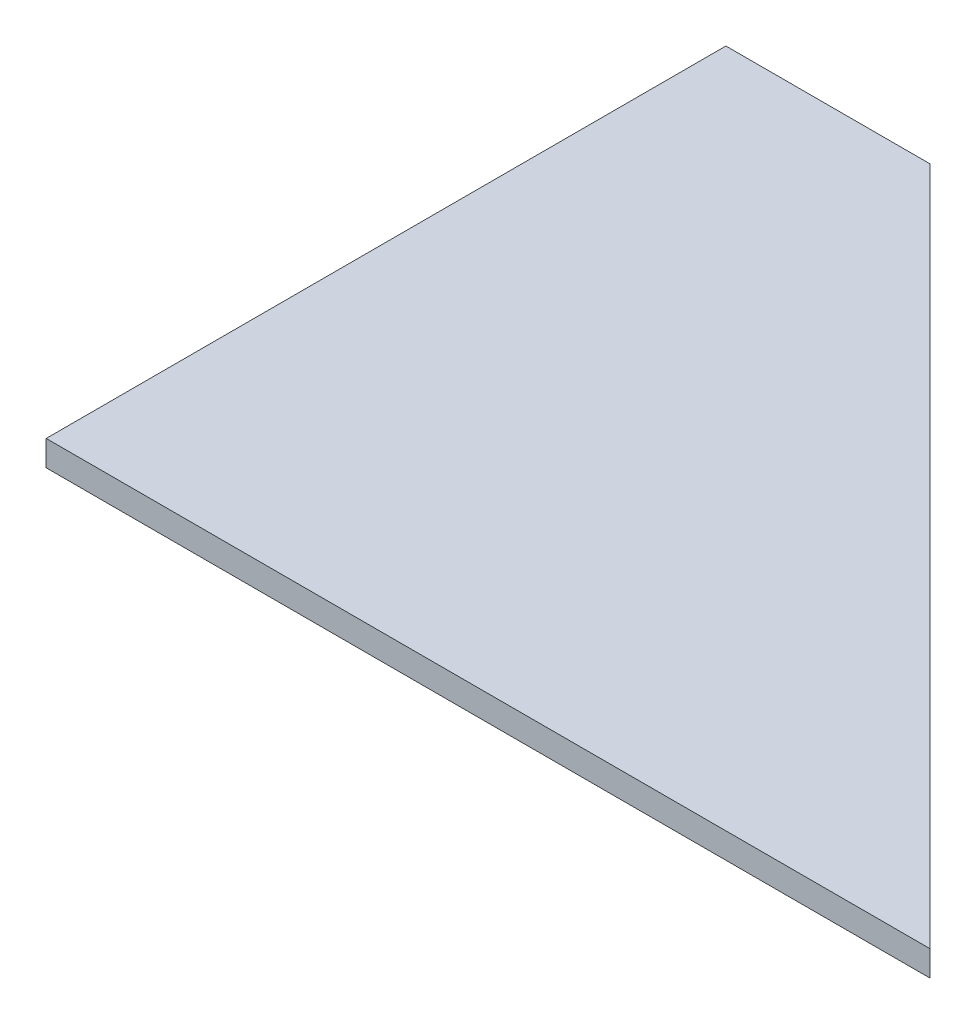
ISO-10303-21;
HEADER;
FILE_DESCRIPTION(('STEP AP214'),'2;1');
FILE_NAME('part.step','',(''),(''),'','','');
FILE_SCHEMA(('AUTOMOTIVE_DESIGN { 1 0 10303 214 1 1 1 1 }'));
ENDSEC;
DATA;
#1=APPLICATION_CONTEXT('core data for automotive mechanical design processes');
#2=APPLICATION_PROTOCOL_DEFINITION('international standard','automotive_design',2000,#1);
#3=PRODUCT_CONTEXT('',#1,'mechanical');
#4=PRODUCT('Part','Part','',(#3));
#5=PRODUCT_RELATED_PRODUCT_CATEGORY('part','',(#4));
#6=PRODUCT_DEFINITION_FORMATION('','',#4);
#7=PRODUCT_DEFINITION_CONTEXT('part definition',#1,'design');
#8=PRODUCT_DEFINITION('design','',#6,#7);
#9=PRODUCT_DEFINITION_SHAPE('','',#8);
#10=(LENGTH_UNIT() NAMED_UNIT(*) SI_UNIT(.MILLI.,.METRE.));
#11=(NAMED_UNIT(*) PLANE_ANGLE_UNIT() SI_UNIT($,.RADIAN.));
#12=(NAMED_UNIT(*) SI_UNIT($,.STERADIAN.) SOLID_ANGLE_UNIT());
#13=UNCERTAINTY_MEASURE_WITH_UNIT(LENGTH_MEASURE(1.E-05),#10,'distance_accuracy_value','');
#14=(GEOMETRIC_REPRESENTATION_CONTEXT(3) GLOBAL_UNCERTAINTY_ASSIGNED_CONTEXT((#13)) GLOBAL_UNIT_ASSIGNED_CONTEXT((#10,
#11,#12)) REPRESENTATION_CONTEXT('',''));
#15=CARTESIAN_POINT('',(0.,0.,0.));
#16=DIRECTION('',(0.,0.,1.));
#17=DIRECTION('',(1.,0.,0.));
#18=AXIS2_PLACEMENT_3D('',#15,#16,#17);
#19=CARTESIAN_POINT('',(-330.200000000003,9.525,0.));
#20=DIRECTION('',(0.,0.,-1.));
#21=DIRECTION('',(-1.,0.,0.));
#22=AXIS2_PLACEMENT_3D('',#19,#20,#21);
#23=PLANE('',#22);
#24=DIRECTION('',(1.,0.,0.));
#25=VECTOR('',#24,1.);
#26=CARTESIAN_POINT('',(-330.200000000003,0.,0.));
#27=LINE('',#26,#25);
#28=CARTESIAN_POINT('',(-330.200000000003,0.,0.));
#29=VERTEX_POINT('',#28);
#30=CARTESIAN_POINT('',(0.,0.,0.));
#31=VERTEX_POINT('',#30);
#32=EDGE_CURVE('E97',#29,#31,#27,.T.);
#33=ORIENTED_EDGE('',*,*,#32,.T.);
#34=DIRECTION('',(0.,-1.,0.));
#35=VECTOR('',#34,1.);
#36=CARTESIAN_POINT('',(0.,9.525,0.));
#37=LINE('',#36,#35);
#38=CARTESIAN_POINT('',(0.,9.525,0.));
#39=VERTEX_POINT('',#38);
#40=EDGE_CURVE('E11',#39,#31,#37,.T.);
#41=ORIENTED_EDGE('',*,*,#40,.F.);
#42=DIRECTION('',(1.,0.,0.));
#43=VECTOR('',#42,1.);
#44=CARTESIAN_POINT('',(-330.200000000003,9.525,0.));
#45=LINE('',#44,#43);
#46=CARTESIAN_POINT('',(-330.200000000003,9.525,0.));
#47=VERTEX_POINT('',#46);
#48=EDGE_CURVE('E85',#47,#39,#45,.T.);
#49=ORIENTED_EDGE('',*,*,#48,.F.);
#50=DIRECTION('',(0.,-1.,0.));
#51=VECTOR('',#50,1.);
#52=CARTESIAN_POINT('',(-330.200000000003,9.525,0.));
#53=LINE('',#52,#51);
#54=EDGE_CURVE('E93',#47,#29,#53,.T.);
#55=ORIENTED_EDGE('',*,*,#54,.T.);
#56=EDGE_LOOP('',(#33,#41,#49,#55));
#57=FACE_BOUND('',#56,.T.);
#58=ADVANCED_FACE('F34',(#57),#23,.F.);
#59=CARTESIAN_POINT('',(0.,9.525,0.));
#60=DIRECTION('',(-0.707106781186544,0.,0.707106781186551));
#61=DIRECTION('',(0.707106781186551,0.,0.707106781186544));
#62=AXIS2_PLACEMENT_3D('',#59,#60,#61);
#63=PLANE('',#62);
#64=DIRECTION('',(-0.707106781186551,0.,-0.707106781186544));
#65=VECTOR('',#64,1.);
#66=CARTESIAN_POINT('',(0.,0.,0.));
#67=LINE('',#66,#65);
#68=CARTESIAN_POINT('',(-254.000000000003,0.,-254.));
#69=VERTEX_POINT('',#68);
#70=EDGE_CURVE('E89',#31,#69,#67,.T.);
#71=ORIENTED_EDGE('',*,*,#70,.T.);
#72=DIRECTION('',(0.,-1.,0.));
#73=VECTOR('',#72,1.);
#74=CARTESIAN_POINT('',(-254.000000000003,9.525,-254.));
#75=LINE('',#74,#73);
#76=CARTESIAN_POINT('',(-254.000000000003,9.525,-254.));
#77=VERTEX_POINT('',#76);
#78=EDGE_CURVE('E42',#77,#69,#75,.T.);
#79=ORIENTED_EDGE('',*,*,#78,.F.);
#80=DIRECTION('',(-0.707106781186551,0.,-0.707106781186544));
#81=VECTOR('',#80,1.);
#82=CARTESIAN_POINT('',(0.,9.525,0.));
#83=LINE('',#82,#81);
#84=EDGE_CURVE('E80',#39,#77,#83,.T.);
#85=ORIENTED_EDGE('',*,*,#84,.F.);
#86=ORIENTED_EDGE('',*,*,#40,.T.);
#87=EDGE_LOOP('',(#71,#79,#85,#86));
#88=FACE_BOUND('',#87,.T.);
#89=ADVANCED_FACE('F88',(#88),#63,.F.);
#90=CARTESIAN_POINT('',(-254.000000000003,9.525,-254.));
#91=DIRECTION('',(0.,0.,1.));
#92=DIRECTION('',(1.,0.,0.));
#93=AXIS2_PLACEMENT_3D('',#90,#91,#92);
#94=PLANE('',#93);
#95=DIRECTION('',(-1.,0.,0.));
#96=VECTOR('',#95,1.);
#97=CARTESIAN_POINT('',(-254.000000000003,0.,-254.));
#98=LINE('',#97,#96);
#99=CARTESIAN_POINT('',(-330.200000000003,0.,-254.));
#100=VERTEX_POINT('',#99);
#101=EDGE_CURVE('E67',#69,#100,#98,.T.);
#102=ORIENTED_EDGE('',*,*,#101,.T.);
#103=DIRECTION('',(0.,-1.,0.));
#104=VECTOR('',#103,1.);
#105=CARTESIAN_POINT('',(-330.200000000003,9.525,-254.));
#106=LINE('',#105,#104);
#107=CARTESIAN_POINT('',(-330.200000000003,9.525,-254.));
#108=VERTEX_POINT('',#107);
#109=EDGE_CURVE('E90',#108,#100,#106,.T.);
#110=ORIENTED_EDGE('',*,*,#109,.F.);
#111=DIRECTION('',(-1.,0.,0.));
#112=VECTOR('',#111,1.);
#113=CARTESIAN_POINT('',(-254.000000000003,9.525,-254.));
#114=LINE('',#113,#112);
#115=EDGE_CURVE('E83',#77,#108,#114,.T.);
#116=ORIENTED_EDGE('',*,*,#115,.F.);
#117=ORIENTED_EDGE('',*,*,#78,.T.);
#118=EDGE_LOOP('',(#102,#110,#116,#117));
#119=FACE_BOUND('',#118,.T.);
#120=ADVANCED_FACE('F91',(#119),#94,.F.);
#121=CARTESIAN_POINT('',(-330.200000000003,9.525,-254.));
#122=DIRECTION('',(1.,0.,0.));
#123=DIRECTION('',(0.,0.,-1.));
#124=AXIS2_PLACEMENT_3D('',#121,#122,#123);
#125=PLANE('',#124);
#126=DIRECTION('',(0.,0.,1.));
#127=VECTOR('',#126,1.);
#128=CARTESIAN_POINT('',(-330.200000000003,0.,-254.));
#129=LINE('',#128,#127);
#130=EDGE_CURVE('E73',#100,#29,#129,.T.);
#131=ORIENTED_EDGE('',*,*,#130,.T.);
#132=ORIENTED_EDGE('',*,*,#54,.F.);
#133=DIRECTION('',(0.,0.,1.));
#134=VECTOR('',#133,1.);
#135=CARTESIAN_POINT('',(-330.200000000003,9.525,-254.));
#136=LINE('',#135,#134);
#137=EDGE_CURVE('E50',#108,#47,#136,.T.);
#138=ORIENTED_EDGE('',*,*,#137,.F.);
#139=ORIENTED_EDGE('',*,*,#109,.T.);
#140=EDGE_LOOP('',(#131,#132,#138,#139));
#141=FACE_BOUND('',#140,.T.);
#142=ADVANCED_FACE('F104',(#141),#125,.F.);
#143=CARTESIAN_POINT('',(0.,9.525,0.));
#144=DIRECTION('',(0.,-1.,0.));
#145=DIRECTION('',(0.,0.,-1.));
#146=AXIS2_PLACEMENT_3D('',#143,#144,#145);
#147=PLANE('',#146);
#148=ORIENTED_EDGE('',*,*,#48,.T.);
#149=ORIENTED_EDGE('',*,*,#84,.T.);
#150=ORIENTED_EDGE('',*,*,#115,.T.);
#151=ORIENTED_EDGE('',*,*,#137,.T.);
#152=EDGE_LOOP('',(#148,#149,#150,#151));
#153=FACE_BOUND('',#152,.T.);
#154=ADVANCED_FACE('F81',(#153),#147,.F.);
#155=CARTESIAN_POINT('',(0.,0.,0.));
#156=DIRECTION('',(0.,-1.,0.));
#157=DIRECTION('',(0.,0.,-1.));
#158=AXIS2_PLACEMENT_3D('',#155,#156,#157);
#159=PLANE('',#158);
#160=ORIENTED_EDGE('',*,*,#32,.F.);
#161=ORIENTED_EDGE('',*,*,#130,.F.);
#162=ORIENTED_EDGE('',*,*,#101,.F.);
#163=ORIENTED_EDGE('',*,*,#70,.F.);
#164=EDGE_LOOP('',(#160,#161,#162,#163));
#165=FACE_BOUND('',#164,.T.);
#166=ADVANCED_FACE('F107',(#165),#159,.T.);
#167=CLOSED_SHELL('',(#58,#89,#120,#142,#154,#166));
#168=MANIFOLD_SOLID_BREP('B2',#167);
#169=ADVANCED_BREP_SHAPE_REPRESENTATION('',(#18,#168),#14);
#170=SHAPE_DEFINITION_REPRESENTATION(#9,#169);
ENDSEC;
END-ISO-10303-21;
